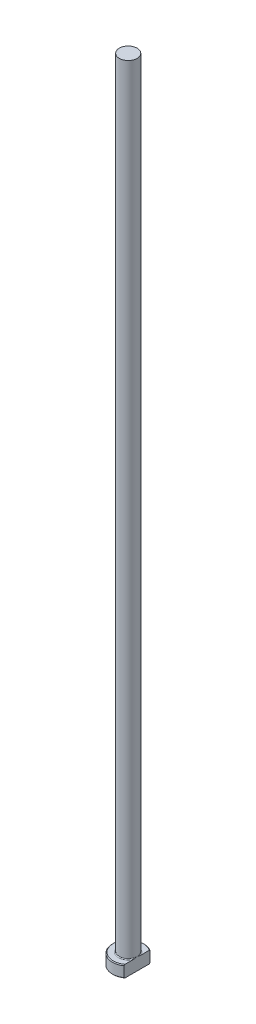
from build123d import *
from build123d.topology import SkipClean

# Parameters (mm, degrees)
CHAMFER1_SIZE = 0.2
FILLET1_R     = 0.2
KEY_DEPTH     = 201.079984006


with BuildPart() as part:
    # Sketch1 → Revolve1 (revolve)
    with BuildSketch(Plane.XY, mode=Mode.PRIVATE) as revolve1_sk:
        Polygon((0, 0), (-4, 0), (-4, 3), (-2.25, 3), (-2.25, 200), (0, 200), align=None)
    revolve(revolve1_sk.sketch.rotate(Axis((0, 259.958771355, 0), (0, -1, 0)), 270), axis=Axis((0, 259.958771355, 0), (0, -1, 0)))

    # Chamfer1
    chamfer1_edges = [part.edges().sort_by_distance(p)[0] for p in [
        (0, 3, -4),
        (0, 0, -4),
    ]]
    chamfer(chamfer1_edges, length=CHAMFER1_SIZE)

    # Fillet1
    fillet1_edges = [part.edges().sort_by_distance(p)[0] for p in [
        (0, 3, -2.25),
    ]]
    fillet(fillet1_edges, radius=FILLET1_R)

    # Sketch2 → KEY (cut, through all)
    with SkipClean():  # the faces are left unmerged after this step: merging them gives an invalid solid
        with BuildSketch(Plane(origin=(0, 0, 0), x_dir=(1, 0, 0), z_dir=(0, 1, 0))):
            with BuildLine():
                Line((2.25, 3.307189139), (2.25, -3.307189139))
                ThreePointArc((2.25, -3.307189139), (4, 0), (2.25, 3.307189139))
            make_face()
        extrude(amount=KEY_DEPTH, mode=Mode.SUBTRACT)


solid = part.part
